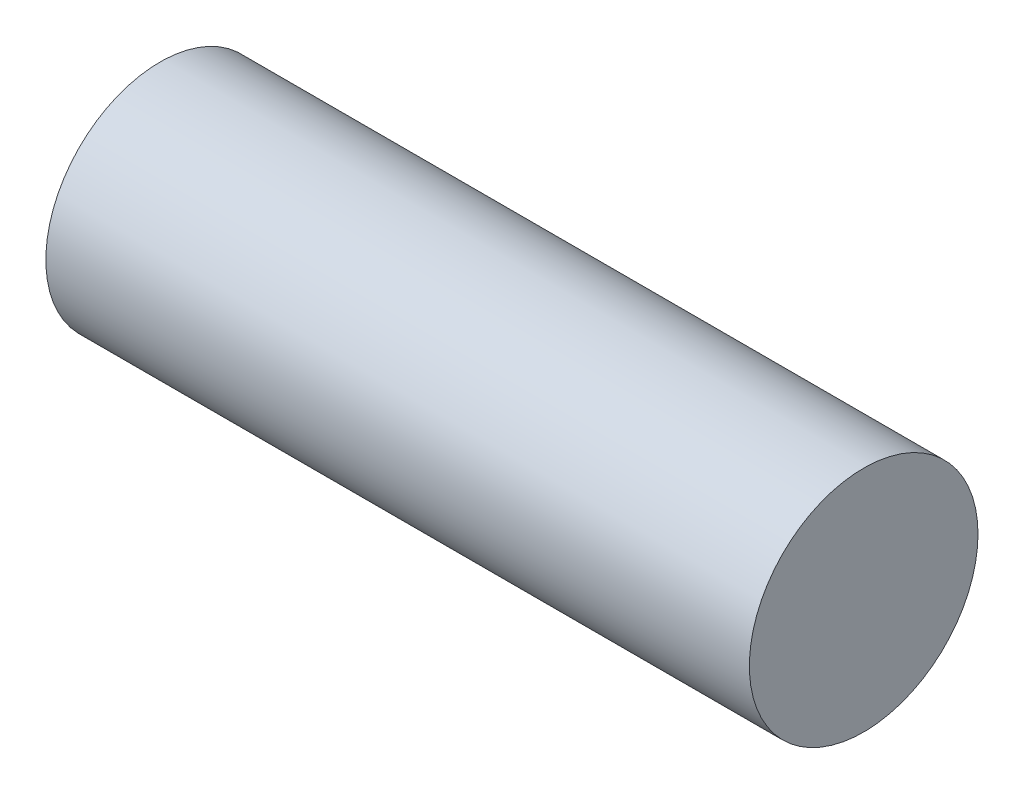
from build123d import *

# Parameters (mm, degrees)
SKETCH1_R           = 2.6
BOSS_EXTRUDE1_DEPTH = 8


with BuildPart() as part:
    # Sketch1 → Boss-Extrude1 (new, symmetric)
    with BuildSketch(Plane(origin=(0, 0, 0), x_dir=(0, 0, -1), z_dir=(1, 0, 0))):
        Circle(SKETCH1_R)
    extrude(amount=BOSS_EXTRUDE1_DEPTH, both=True)


solid = part.part
